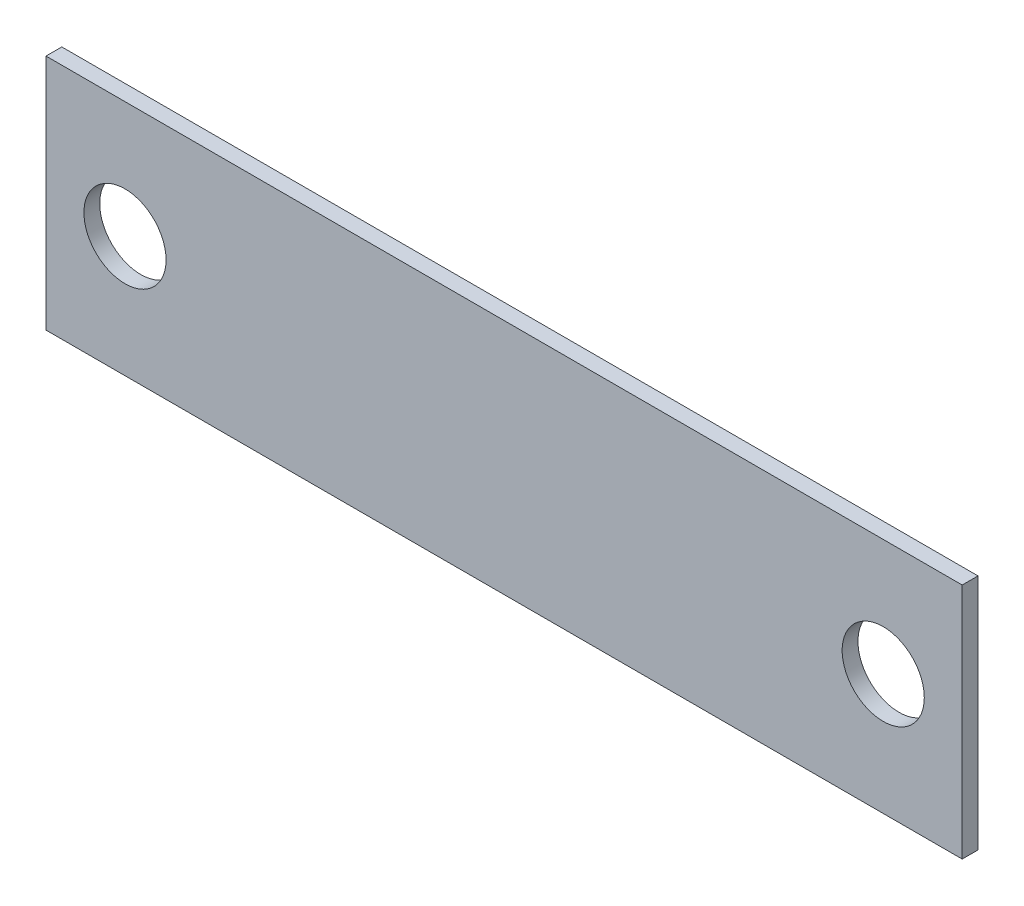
from build123d import *

# Parameters (mm, degrees)
ESQUISSE1_W             = 580
ESQUISSE1_H             = 150.26
BOSS_EXTRU_1_DEPTH      = 10
ESQUISSE2_R             = 26
ENL_V_MAT_EXTRU_1_DEPTH = 10


with BuildPart() as part:
    # Esquisse1 → Boss.-Extru.1 (new body)
    with BuildSketch(Plane.XY):
        with Locations((228.489476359, -45.930824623)):
            Rectangle(ESQUISSE1_W, ESQUISSE1_H)
    extrude(amount=BOSS_EXTRU_1_DEPTH)

    # Esquisse2 → Enl_v. mat.-Extru.1 (cut)
    with BuildSketch(Plane.XY.offset(10)):
        with Locations((-11.510523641, -44.612615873)):
            Circle(ESQUISSE2_R)
        with Locations((468.489476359, -44.612615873)):
            Circle(ESQUISSE2_R)
    extrude(amount=-ENL_V_MAT_EXTRU_1_DEPTH, mode=Mode.SUBTRACT)


solid = part.part
